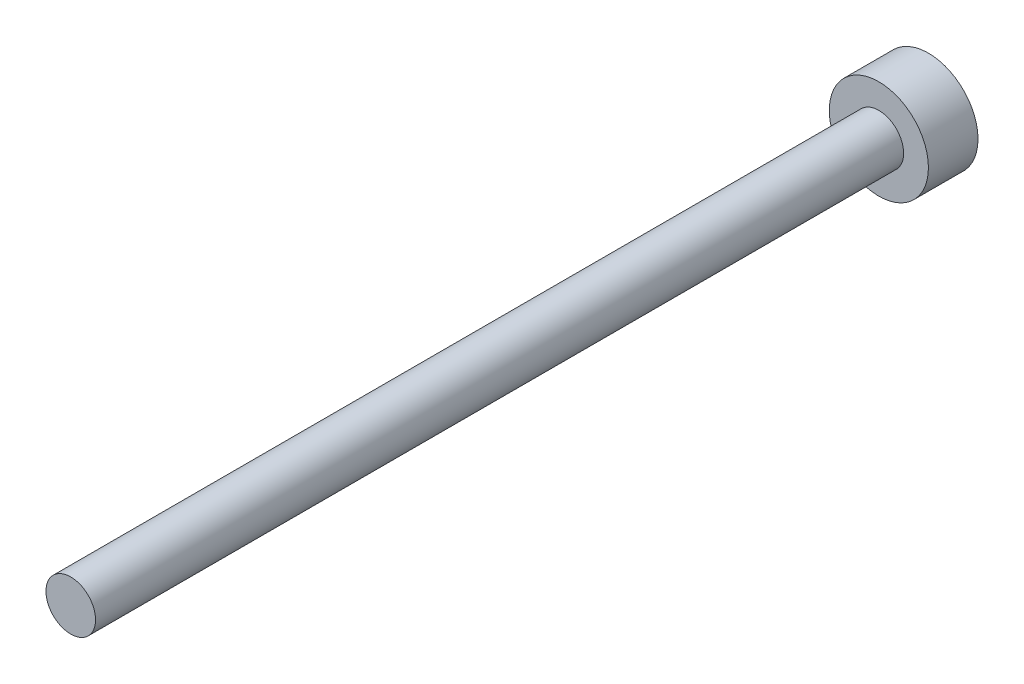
from build123d import *

# Parameters (mm, degrees)
ESQUISSE1_R        = 2
BOSS_EXTRU_1_DEPTH = 2
ESQUISSE2_R        = 1
BOSS_EXTRU_2_DEPTH = 32.6


with BuildPart() as part:
    # Esquisse1 → Boss.-Extru.1 (new body)
    with BuildSketch(Plane.XY):
        Circle(ESQUISSE1_R)
    extrude(amount=BOSS_EXTRU_1_DEPTH)

    # Esquisse2 → Boss.-Extru.2 (add)
    with BuildSketch(Plane.XY.offset(2)):
        Circle(ESQUISSE2_R)
    extrude(amount=BOSS_EXTRU_2_DEPTH)


solid = part.part
